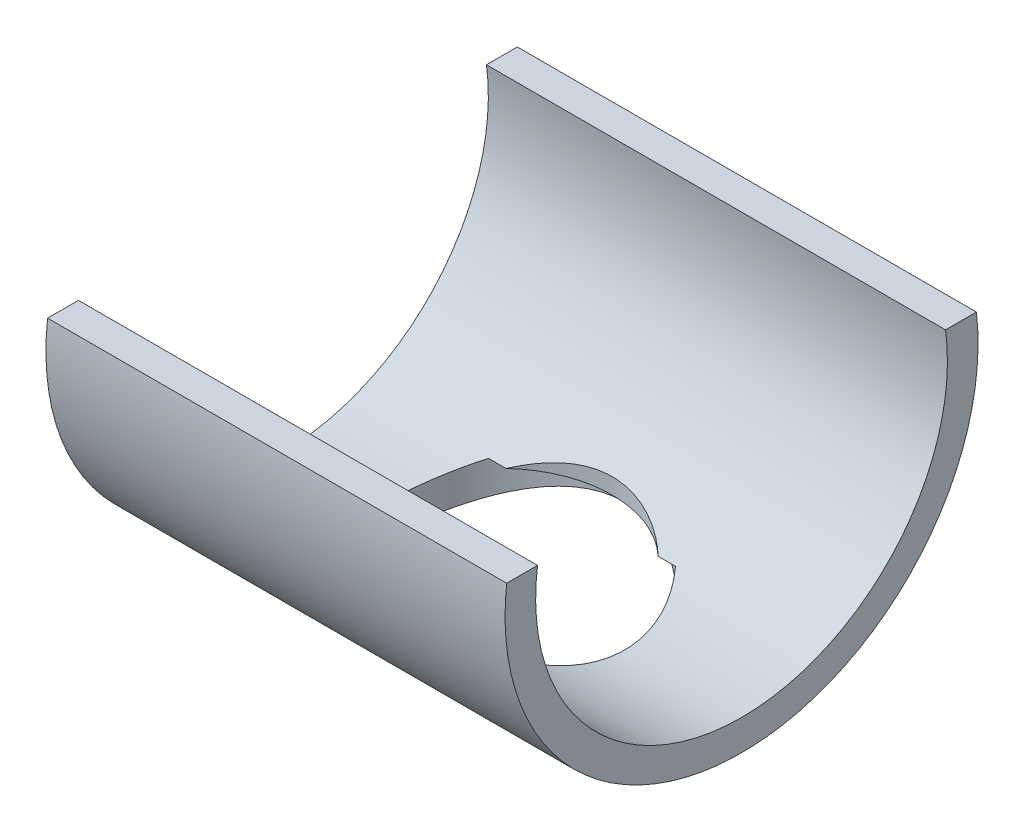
from build123d import *

# Parameters (mm, degrees)
DEMI_COQUILLE_DEPTH      = 86.5
DEMI_COQUILLE_DEPTH_BACK = 78.5


with BuildPart() as part:
    # Esquisse1 → Demi coquille (new, two sides: drawn at the far end of the back side and taken through both)
    with BuildSketch(Plane(origin=(0, 0, 0), x_dir=(0, 0, -1), z_dir=(1, 0, 0)).offset(-DEMI_COQUILLE_DEPTH_BACK)):
        with BuildLine():
            Line((-84.409715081, 10), (-73.321211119, 10))
            ThreePointArc((-73.321211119, 10), (0, -74), (73.321211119, 10))
            Line((73.321211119, 10), (84.409715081, 10))
            ThreePointArc((84.409715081, 10), (0, -85), (-84.409715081, 10))
        make_face()
    extrude(amount=DEMI_COQUILLE_DEPTH + DEMI_COQUILLE_DEPTH_BACK)

    # Esquisse3 → MIP tube (revolve, cut)
    with BuildSketch(Plane.XY, mode=Mode.PRIVATE) as mip_tube_sk:
        Polygon((0, -85), (-44.5, -85), (-44.5, -68), (-40, -68), (-40, 10), (0, 10), align=None)
    revolve(mip_tube_sk.sketch.rotate(Axis((0, -107.741237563, 0), (0, 1, 0)), 270), axis=Axis((0, -107.741237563, 0), (0, 1, 0)), mode=Mode.SUBTRACT)


solid = part.part
